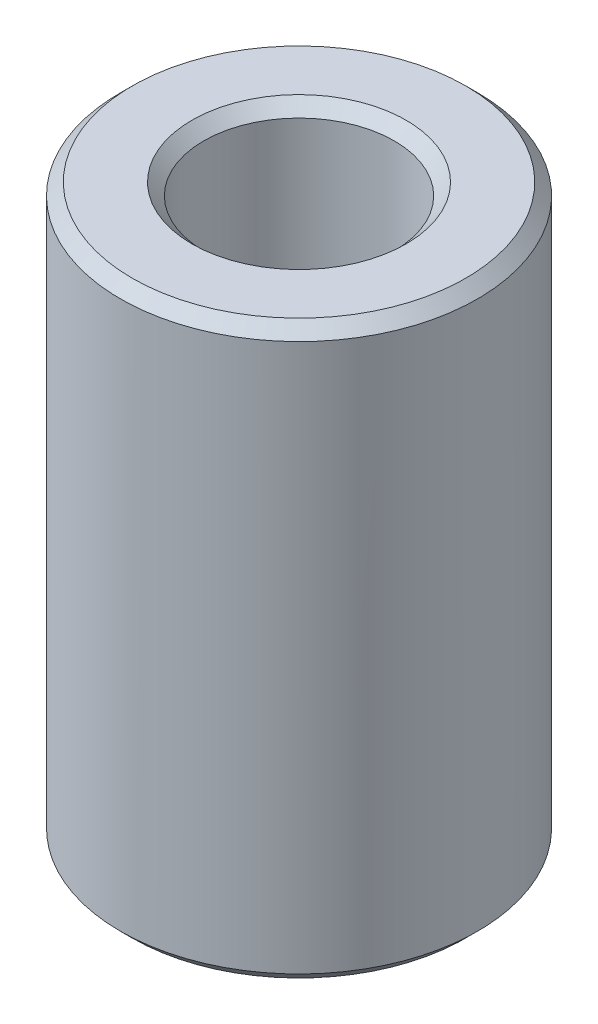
ISO-10303-21;
HEADER;
FILE_DESCRIPTION(('STEP AP214'),'2;1');
FILE_NAME('part.step','',(''),(''),'','','');
FILE_SCHEMA(('AUTOMOTIVE_DESIGN { 1 0 10303 214 1 1 1 1 }'));
ENDSEC;
DATA;
#1=APPLICATION_CONTEXT('core data for automotive mechanical design processes');
#2=APPLICATION_PROTOCOL_DEFINITION('international standard','automotive_design',2000,#1);
#3=PRODUCT_CONTEXT('',#1,'mechanical');
#4=PRODUCT('Part','Part','',(#3));
#5=PRODUCT_RELATED_PRODUCT_CATEGORY('part','',(#4));
#6=PRODUCT_DEFINITION_FORMATION('','',#4);
#7=PRODUCT_DEFINITION_CONTEXT('part definition',#1,'design');
#8=PRODUCT_DEFINITION('design','',#6,#7);
#9=PRODUCT_DEFINITION_SHAPE('','',#8);
#10=(LENGTH_UNIT() NAMED_UNIT(*) SI_UNIT(.MILLI.,.METRE.));
#11=(NAMED_UNIT(*) PLANE_ANGLE_UNIT() SI_UNIT($,.RADIAN.));
#12=(NAMED_UNIT(*) SI_UNIT($,.STERADIAN.) SOLID_ANGLE_UNIT());
#13=UNCERTAINTY_MEASURE_WITH_UNIT(LENGTH_MEASURE(1.E-05),#10,'distance_accuracy_value','');
#14=(GEOMETRIC_REPRESENTATION_CONTEXT(3) GLOBAL_UNCERTAINTY_ASSIGNED_CONTEXT((#13)) GLOBAL_UNIT_ASSIGNED_CONTEXT((#10,
#11,#12)) REPRESENTATION_CONTEXT('',''));
#15=CARTESIAN_POINT('',(0.,0.,0.));
#16=DIRECTION('',(0.,0.,1.));
#17=DIRECTION('',(1.,0.,0.));
#18=AXIS2_PLACEMENT_3D('',#15,#16,#17);
#19=CARTESIAN_POINT('',(0.,24.,0.));
#20=DIRECTION('',(0.,-1.,0.));
#21=DIRECTION('',(0.,0.,-1.));
#22=AXIS2_PLACEMENT_3D('',#19,#20,#21);
#23=CYLINDRICAL_SURFACE('',#22,4.);
#24=CARTESIAN_POINT('',(0.,0.499999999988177,0.));
#25=DIRECTION('',(0.,-1.,0.));
#26=DIRECTION('',(0.,0.,-1.));
#27=AXIS2_PLACEMENT_3D('',#24,#25,#26);
#28=CIRCLE('',#27,4.0000000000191);
#29=CARTESIAN_POINT('',(0.,0.499999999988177,-4.0000000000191));
#30=VERTEX_POINT('',#29);
#31=EDGE_CURVE('E30',#30,#30,#28,.T.);
#32=ORIENTED_EDGE('',*,*,#31,.T.);
#33=EDGE_LOOP('',(#32));
#34=FACE_BOUND('',#33,.T.);
#35=CARTESIAN_POINT('',(0.,23.5000000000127,0.));
#36=DIRECTION('',(0.,1.,0.));
#37=DIRECTION('',(0.,0.,1.));
#38=AXIS2_PLACEMENT_3D('',#35,#36,#37);
#39=CIRCLE('',#38,4.0000000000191);
#40=CARTESIAN_POINT('',(0.,23.5000000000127,4.0000000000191));
#41=VERTEX_POINT('',#40);
#42=EDGE_CURVE('E33',#41,#41,#39,.T.);
#43=ORIENTED_EDGE('',*,*,#42,.T.);
#44=EDGE_LOOP('',(#43));
#45=FACE_BOUND('',#44,.T.);
#46=ADVANCED_FACE('F15',(#34,#45),#23,.F.);
#47=CARTESIAN_POINT('',(0.,23.9999999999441,0.));
#48=DIRECTION('',(0.,1.,0.));
#49=DIRECTION('',(0.,0.,1.));
#50=AXIS2_PLACEMENT_3D('',#47,#48,#49);
#51=CONICAL_SURFACE('',#50,4.49999999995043,0.785398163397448);
#52=ORIENTED_EDGE('',*,*,#42,.F.);
#53=EDGE_LOOP('',(#52));
#54=FACE_BOUND('',#53,.T.);
#55=CARTESIAN_POINT('',(0.,24.0000000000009,0.));
#56=DIRECTION('',(0.,1.,0.));
#57=DIRECTION('',(0.,0.,1.));
#58=AXIS2_PLACEMENT_3D('',#55,#56,#57);
#59=CIRCLE('',#58,4.50000000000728);
#60=CARTESIAN_POINT('',(0.,24.0000000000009,4.50000000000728));
#61=VERTEX_POINT('',#60);
#62=EDGE_CURVE('E18',#61,#61,#59,.F.);
#63=ORIENTED_EDGE('',*,*,#62,.F.);
#64=EDGE_LOOP('',(#63));
#65=FACE_BOUND('',#64,.T.);
#66=ADVANCED_FACE('F49',(#54,#65),#51,.F.);
#67=CARTESIAN_POINT('',(0.,1.13686837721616E-10,0.));
#68=DIRECTION('',(0.,-1.,0.));
#69=DIRECTION('',(0.,0.,-1.));
#70=AXIS2_PLACEMENT_3D('',#67,#68,#69);
#71=CONICAL_SURFACE('',#70,4.49999999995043,0.785398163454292);
#72=CARTESIAN_POINT('',(0.,5.68434188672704E-11,0.));
#73=DIRECTION('',(0.,-1.,0.));
#74=DIRECTION('',(0.,0.,-1.));
#75=AXIS2_PLACEMENT_3D('',#72,#73,#74);
#76=CIRCLE('',#75,4.50000000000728);
#77=CARTESIAN_POINT('',(0.,5.68434188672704E-11,-4.50000000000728));
#78=VERTEX_POINT('',#77);
#79=EDGE_CURVE('E40',#78,#78,#76,.T.);
#80=ORIENTED_EDGE('',*,*,#79,.T.);
#81=EDGE_LOOP('',(#80));
#82=FACE_BOUND('',#81,.T.);
#83=ORIENTED_EDGE('',*,*,#31,.F.);
#84=EDGE_LOOP('',(#83));
#85=FACE_BOUND('',#84,.T.);
#86=ADVANCED_FACE('F51',(#82,#85),#71,.F.);
#87=CARTESIAN_POINT('',(0.,24.,0.));
#88=DIRECTION('',(0.,1.,0.));
#89=DIRECTION('',(0.,0.,1.));
#90=AXIS2_PLACEMENT_3D('',#87,#88,#89);
#91=PLANE('',#90);
#92=CARTESIAN_POINT('',(0.,24.0000000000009,0.));
#93=DIRECTION('',(0.,-1.,0.));
#94=DIRECTION('',(0.,0.,-1.));
#95=AXIS2_PLACEMENT_3D('',#92,#93,#94);
#96=CIRCLE('',#95,6.99999999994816);
#97=CARTESIAN_POINT('',(0.,24.0000000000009,-6.99999999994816));
#98=VERTEX_POINT('',#97);
#99=EDGE_CURVE('E38',#98,#98,#96,.T.);
#100=ORIENTED_EDGE('',*,*,#99,.F.);
#101=EDGE_LOOP('',(#100));
#102=FACE_BOUND('',#101,.T.);
#103=ORIENTED_EDGE('',*,*,#62,.T.);
#104=EDGE_LOOP('',(#103));
#105=FACE_BOUND('',#104,.T.);
#106=ADVANCED_FACE('F47',(#102,#105),#91,.T.);
#107=CARTESIAN_POINT('',(0.,0.,0.));
#108=DIRECTION('',(0.,1.,0.));
#109=DIRECTION('',(0.,0.,1.));
#110=AXIS2_PLACEMENT_3D('',#107,#108,#109);
#111=PLANE('',#110);
#112=CARTESIAN_POINT('',(0.,0.,0.));
#113=DIRECTION('',(0.,1.,0.));
#114=DIRECTION('',(0.,0.,1.));
#115=AXIS2_PLACEMENT_3D('',#112,#113,#114);
#116=CIRCLE('',#115,7.);
#117=CARTESIAN_POINT('',(0.,0.,7.));
#118=VERTEX_POINT('',#117);
#119=EDGE_CURVE('E27',#118,#118,#116,.T.);
#120=ORIENTED_EDGE('',*,*,#119,.F.);
#121=EDGE_LOOP('',(#120));
#122=FACE_BOUND('',#121,.T.);
#123=ORIENTED_EDGE('',*,*,#79,.F.);
#124=EDGE_LOOP('',(#123));
#125=FACE_BOUND('',#124,.T.);
#126=ADVANCED_FACE('F75',(#122,#125),#111,.F.);
#127=CARTESIAN_POINT('',(0.,23.4999999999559,0.));
#128=DIRECTION('',(0.,-1.,0.));
#129=DIRECTION('',(0.,0.,-1.));
#130=AXIS2_PLACEMENT_3D('',#127,#128,#129);
#131=CONICAL_SURFACE('',#130,7.50000000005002,0.785398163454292);
#132=CARTESIAN_POINT('',(0.,23.5,0.));
#133=DIRECTION('',(0.,-1.,0.));
#134=DIRECTION('',(0.,0.,-1.));
#135=AXIS2_PLACEMENT_3D('',#132,#133,#134);
#136=CIRCLE('',#135,7.5);
#137=CARTESIAN_POINT('',(0.,23.5,-7.5));
#138=VERTEX_POINT('',#137);
#139=EDGE_CURVE('E22',#138,#138,#136,.T.);
#140=ORIENTED_EDGE('',*,*,#139,.F.);
#141=EDGE_LOOP('',(#140));
#142=FACE_BOUND('',#141,.T.);
#143=ORIENTED_EDGE('',*,*,#99,.T.);
#144=EDGE_LOOP('',(#143));
#145=FACE_BOUND('',#144,.T.);
#146=ADVANCED_FACE('F68',(#142,#145),#131,.T.);
#147=CARTESIAN_POINT('',(0.,0.500000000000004,0.));
#148=DIRECTION('',(0.,1.,0.));
#149=DIRECTION('',(0.,0.,1.));
#150=AXIS2_PLACEMENT_3D('',#147,#148,#149);
#151=CONICAL_SURFACE('',#150,7.5,0.785398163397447);
#152=CARTESIAN_POINT('',(0.,0.500000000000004,0.));
#153=DIRECTION('',(0.,-1.,0.));
#154=DIRECTION('',(0.,0.,-1.));
#155=AXIS2_PLACEMENT_3D('',#152,#153,#154);
#156=CIRCLE('',#155,7.5);
#157=CARTESIAN_POINT('',(0.,0.500000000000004,-7.5));
#158=VERTEX_POINT('',#157);
#159=EDGE_CURVE('E10',#158,#158,#156,.F.);
#160=ORIENTED_EDGE('',*,*,#159,.F.);
#161=EDGE_LOOP('',(#160));
#162=FACE_BOUND('',#161,.T.);
#163=ORIENTED_EDGE('',*,*,#119,.T.);
#164=EDGE_LOOP('',(#163));
#165=FACE_BOUND('',#164,.T.);
#166=ADVANCED_FACE('F63',(#162,#165),#151,.T.);
#167=CARTESIAN_POINT('',(0.,24.,0.));
#168=DIRECTION('',(0.,-1.,0.));
#169=DIRECTION('',(0.,0.,-1.));
#170=AXIS2_PLACEMENT_3D('',#167,#168,#169);
#171=CYLINDRICAL_SURFACE('',#170,7.5);
#172=ORIENTED_EDGE('',*,*,#159,.T.);
#173=EDGE_LOOP('',(#172));
#174=FACE_BOUND('',#173,.T.);
#175=ORIENTED_EDGE('',*,*,#139,.T.);
#176=EDGE_LOOP('',(#175));
#177=FACE_BOUND('',#176,.T.);
#178=ADVANCED_FACE('F61',(#174,#177),#171,.T.);
#179=CLOSED_SHELL('',(#46,#66,#86,#106,#126,#146,#166,#178));
#180=MANIFOLD_SOLID_BREP('B1',#179);
#181=ADVANCED_BREP_SHAPE_REPRESENTATION('',(#18,#180),#14);
#182=SHAPE_DEFINITION_REPRESENTATION(#9,#181);
ENDSEC;
END-ISO-10303-21;
